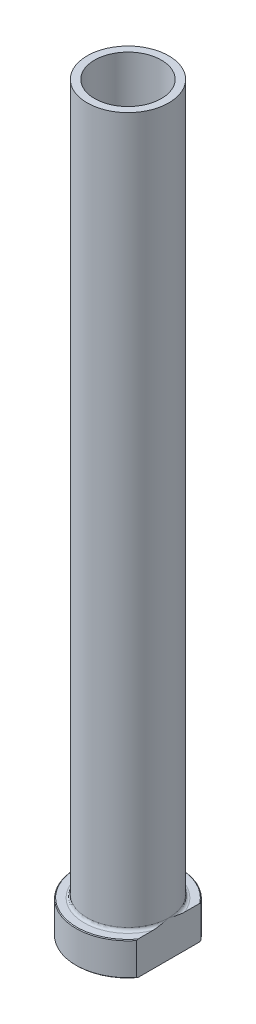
from build123d import *

# Parameters (mm, degrees)
FILLET1_R          = 0.8
CHAMFER1_SIZE      = 0.2
CUT_EXTRUDE1_DEPTH = 201.977610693
CHAMFER2_SIZE      = 0.5


with BuildPart() as part:
    # Sketch1 → Revolve1 (revolve)
    with BuildSketch(Plane.XY, mode=Mode.PRIVATE) as revolve1_sk:
        Polygon((-9, 200), (-11, 200), (-11, 9), (-14, 9), (-14, 0), (-9.25, 0), (-9.25, 133), (-9, 145), align=None)
    revolve(revolve1_sk.sketch.rotate(Axis((0, 92.187680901, 0), (0, -1, 0)), 270), axis=Axis((0, 92.187680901, 0), (0, -1, 0)))

    # Fillet1
    fillet1_edges = [part.edges().sort_by_distance(p)[0] for p in [
        (0, 9, -11),
    ]]
    fillet(fillet1_edges, radius=FILLET1_R)

    # Chamfer1
    chamfer1_edges = [part.edges().sort_by_distance(p)[0] for p in [
        (0, 0, -14),
        (0, 9, -14),
    ]]
    chamfer(chamfer1_edges, length=CHAMFER1_SIZE)

    # Sketch2 → Cut-Extrude1 (cut, through all)
    with BuildSketch(Plane.XZ):
        with BuildLine():
            Line((11, 8.660254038), (11, -8.660254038))
            ThreePointArc((11, -8.660254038), (14, 0), (11, 8.660254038))
        make_face()
    extrude(amount=-CUT_EXTRUDE1_DEPTH, mode=Mode.SUBTRACT)

    # Chamfer2
    chamfer2_edges = [part.edges().sort_by_distance(p)[0] for p in [
        (0, 0, -9.25),
    ]]
    chamfer(chamfer2_edges, length=CHAMFER2_SIZE)


solid = part.part
